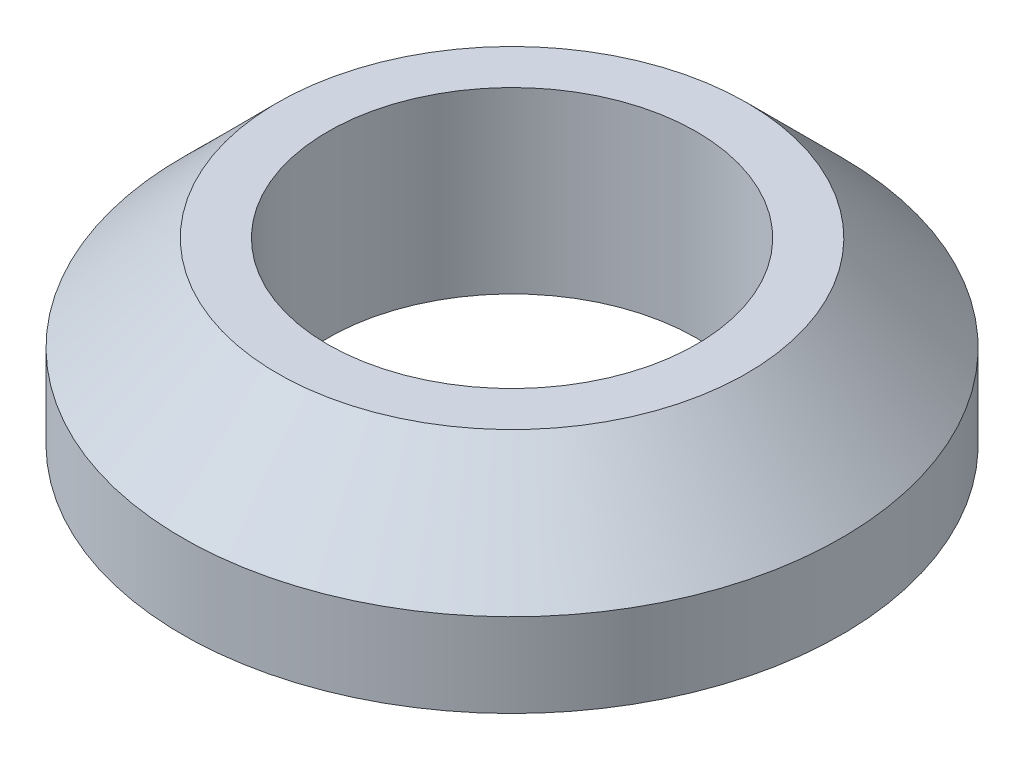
ISO-10303-21;
HEADER;
FILE_DESCRIPTION(('STEP AP214'),'2;1');
FILE_NAME('part.step','',(''),(''),'','','');
FILE_SCHEMA(('AUTOMOTIVE_DESIGN { 1 0 10303 214 1 1 1 1 }'));
ENDSEC;
DATA;
#1=APPLICATION_CONTEXT('core data for automotive mechanical design processes');
#2=APPLICATION_PROTOCOL_DEFINITION('international standard','automotive_design',2000,#1);
#3=PRODUCT_CONTEXT('',#1,'mechanical');
#4=PRODUCT('Part','Part','',(#3));
#5=PRODUCT_RELATED_PRODUCT_CATEGORY('part','',(#4));
#6=PRODUCT_DEFINITION_FORMATION('','',#4);
#7=PRODUCT_DEFINITION_CONTEXT('part definition',#1,'design');
#8=PRODUCT_DEFINITION('design','',#6,#7);
#9=PRODUCT_DEFINITION_SHAPE('','',#8);
#10=(LENGTH_UNIT() NAMED_UNIT(*) SI_UNIT(.MILLI.,.METRE.));
#11=(NAMED_UNIT(*) PLANE_ANGLE_UNIT() SI_UNIT($,.RADIAN.));
#12=(NAMED_UNIT(*) SI_UNIT($,.STERADIAN.) SOLID_ANGLE_UNIT());
#13=UNCERTAINTY_MEASURE_WITH_UNIT(LENGTH_MEASURE(1.E-05),#10,'distance_accuracy_value','');
#14=(GEOMETRIC_REPRESENTATION_CONTEXT(3) GLOBAL_UNCERTAINTY_ASSIGNED_CONTEXT((#13)) GLOBAL_UNIT_ASSIGNED_CONTEXT((#10,
#11,#12)) REPRESENTATION_CONTEXT('',''));
#15=CARTESIAN_POINT('',(0.,0.,0.));
#16=DIRECTION('',(0.,0.,1.));
#17=DIRECTION('',(1.,0.,0.));
#18=AXIS2_PLACEMENT_3D('',#15,#16,#17);
#19=CARTESIAN_POINT('',(5.9,0.,0.));
#20=DIRECTION('',(0.,-1.,0.));
#21=DIRECTION('',(0.,0.,-1.));
#22=AXIS2_PLACEMENT_3D('',#19,#20,#21);
#23=PLANE('',#22);
#24=CARTESIAN_POINT('',(0.,0.,0.));
#25=DIRECTION('',(0.,-1.,0.));
#26=DIRECTION('',(0.,0.,-1.));
#27=AXIS2_PLACEMENT_3D('',#24,#25,#26);
#28=CIRCLE('',#27,5.9);
#29=CARTESIAN_POINT('',(0.,0.,-5.9));
#30=VERTEX_POINT('',#29);
#31=EDGE_CURVE('E31',#30,#30,#28,.T.);
#32=ORIENTED_EDGE('',*,*,#31,.T.);
#33=EDGE_LOOP('',(#32));
#34=FACE_BOUND('',#33,.T.);
#35=CARTESIAN_POINT('',(0.,0.,0.));
#36=DIRECTION('',(0.,-1.,0.));
#37=DIRECTION('',(0.,0.,-1.));
#38=AXIS2_PLACEMENT_3D('',#35,#36,#37);
#39=CIRCLE('',#38,3.3);
#40=CARTESIAN_POINT('',(0.,0.,-3.3));
#41=VERTEX_POINT('',#40);
#42=EDGE_CURVE('E8',#41,#41,#39,.T.);
#43=ORIENTED_EDGE('',*,*,#42,.F.);
#44=EDGE_LOOP('',(#43));
#45=FACE_BOUND('',#44,.T.);
#46=ADVANCED_FACE('F12',(#34,#45),#23,.T.);
#47=CARTESIAN_POINT('',(0.,0.,0.));
#48=DIRECTION('',(0.,-1.,0.));
#49=DIRECTION('',(0.,0.,-1.));
#50=AXIS2_PLACEMENT_3D('',#47,#48,#49);
#51=CYLINDRICAL_SURFACE('',#50,3.3);
#52=ORIENTED_EDGE('',*,*,#42,.T.);
#53=EDGE_LOOP('',(#52));
#54=FACE_BOUND('',#53,.T.);
#55=CARTESIAN_POINT('',(0.,3.2,0.));
#56=DIRECTION('',(0.,-1.,0.));
#57=DIRECTION('',(0.,0.,-1.));
#58=AXIS2_PLACEMENT_3D('',#55,#56,#57);
#59=CIRCLE('',#58,3.3);
#60=CARTESIAN_POINT('',(0.,3.2,-3.3));
#61=VERTEX_POINT('',#60);
#62=EDGE_CURVE('E18',#61,#61,#59,.T.);
#63=ORIENTED_EDGE('',*,*,#62,.F.);
#64=EDGE_LOOP('',(#63));
#65=FACE_BOUND('',#64,.T.);
#66=ADVANCED_FACE('F51',(#54,#65),#51,.F.);
#67=CARTESIAN_POINT('',(3.3,3.2,0.));
#68=DIRECTION('',(0.,1.,0.));
#69=DIRECTION('',(0.,0.,1.));
#70=AXIS2_PLACEMENT_3D('',#67,#68,#69);
#71=PLANE('',#70);
#72=ORIENTED_EDGE('',*,*,#62,.T.);
#73=EDGE_LOOP('',(#72));
#74=FACE_BOUND('',#73,.T.);
#75=CARTESIAN_POINT('',(0.,3.2,0.));
#76=DIRECTION('',(0.,-1.,0.));
#77=DIRECTION('',(0.,0.,-1.));
#78=AXIS2_PLACEMENT_3D('',#75,#76,#77);
#79=CIRCLE('',#78,4.2);
#80=CARTESIAN_POINT('',(0.,3.2,-4.2));
#81=VERTEX_POINT('',#80);
#82=EDGE_CURVE('E22',#81,#81,#79,.T.);
#83=ORIENTED_EDGE('',*,*,#82,.F.);
#84=EDGE_LOOP('',(#83));
#85=FACE_BOUND('',#84,.T.);
#86=ADVANCED_FACE('F47',(#74,#85),#71,.T.);
#87=CARTESIAN_POINT('',(0.,1.5,0.));
#88=DIRECTION('',(0.,-1.,0.));
#89=DIRECTION('',(0.,0.,-1.));
#90=AXIS2_PLACEMENT_3D('',#87,#88,#89);
#91=CONICAL_SURFACE('',#90,5.9,0.785398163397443);
#92=ORIENTED_EDGE('',*,*,#82,.T.);
#93=EDGE_LOOP('',(#92));
#94=FACE_BOUND('',#93,.T.);
#95=CARTESIAN_POINT('',(0.,1.5,0.));
#96=DIRECTION('',(0.,-1.,0.));
#97=DIRECTION('',(0.,0.,-1.));
#98=AXIS2_PLACEMENT_3D('',#95,#96,#97);
#99=CIRCLE('',#98,5.9);
#100=CARTESIAN_POINT('',(0.,1.5,-5.9));
#101=VERTEX_POINT('',#100);
#102=EDGE_CURVE('E26',#101,#101,#99,.T.);
#103=ORIENTED_EDGE('',*,*,#102,.F.);
#104=EDGE_LOOP('',(#103));
#105=FACE_BOUND('',#104,.T.);
#106=ADVANCED_FACE('F39',(#94,#105),#91,.T.);
#107=CARTESIAN_POINT('',(0.,0.,0.));
#108=DIRECTION('',(0.,-1.,0.));
#109=DIRECTION('',(0.,0.,-1.));
#110=AXIS2_PLACEMENT_3D('',#107,#108,#109);
#111=CYLINDRICAL_SURFACE('',#110,5.9);
#112=ORIENTED_EDGE('',*,*,#102,.T.);
#113=EDGE_LOOP('',(#112));
#114=FACE_BOUND('',#113,.T.);
#115=ORIENTED_EDGE('',*,*,#31,.F.);
#116=EDGE_LOOP('',(#115));
#117=FACE_BOUND('',#116,.T.);
#118=ADVANCED_FACE('F37',(#114,#117),#111,.T.);
#119=CLOSED_SHELL('',(#46,#66,#86,#106,#118));
#120=MANIFOLD_SOLID_BREP('B1',#119);
#121=ADVANCED_BREP_SHAPE_REPRESENTATION('',(#18,#120),#14);
#122=SHAPE_DEFINITION_REPRESENTATION(#9,#121);
ENDSEC;
END-ISO-10303-21;
